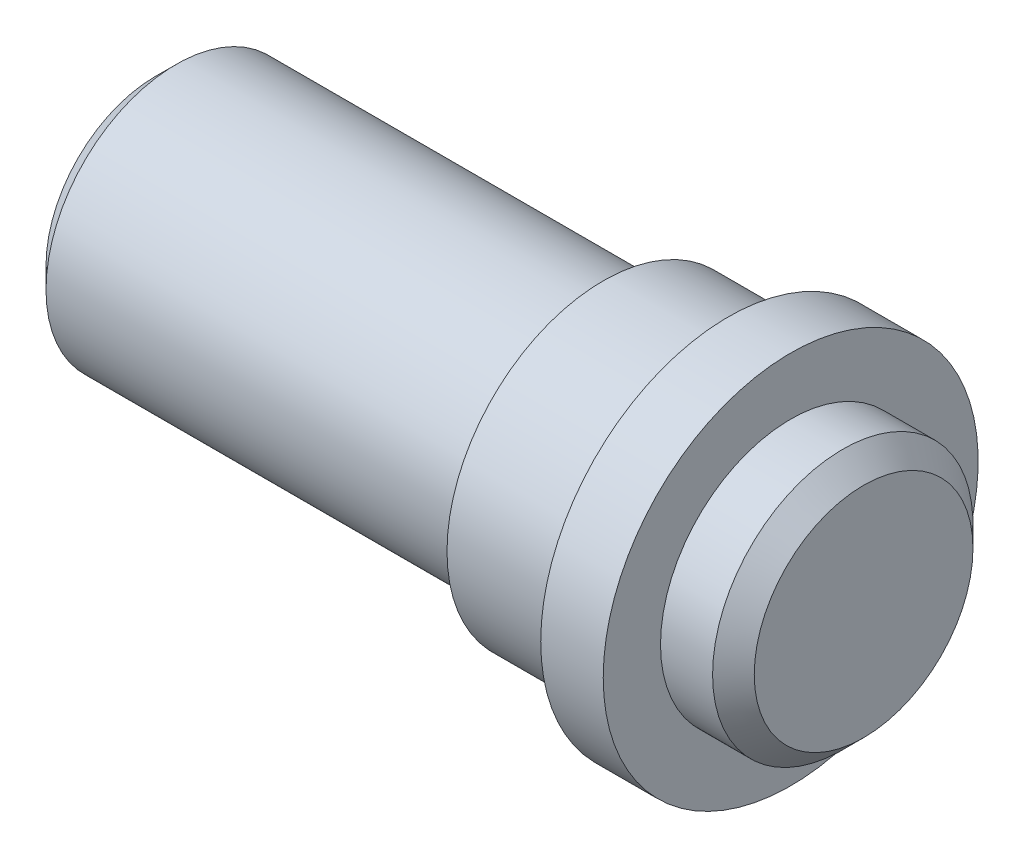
ISO-10303-21;
HEADER;
FILE_DESCRIPTION(('STEP AP214'),'2;1');
FILE_NAME('part.step','',(''),(''),'','','');
FILE_SCHEMA(('AUTOMOTIVE_DESIGN { 1 0 10303 214 1 1 1 1 }'));
ENDSEC;
DATA;
#1=APPLICATION_CONTEXT('core data for automotive mechanical design processes');
#2=APPLICATION_PROTOCOL_DEFINITION('international standard','automotive_design',2000,#1);
#3=PRODUCT_CONTEXT('',#1,'mechanical');
#4=PRODUCT('Part','Part','',(#3));
#5=PRODUCT_RELATED_PRODUCT_CATEGORY('part','',(#4));
#6=PRODUCT_DEFINITION_FORMATION('','',#4);
#7=PRODUCT_DEFINITION_CONTEXT('part definition',#1,'design');
#8=PRODUCT_DEFINITION('design','',#6,#7);
#9=PRODUCT_DEFINITION_SHAPE('','',#8);
#10=(LENGTH_UNIT() NAMED_UNIT(*) SI_UNIT(.MILLI.,.METRE.));
#11=(NAMED_UNIT(*) PLANE_ANGLE_UNIT() SI_UNIT($,.RADIAN.));
#12=(NAMED_UNIT(*) SI_UNIT($,.STERADIAN.) SOLID_ANGLE_UNIT());
#13=UNCERTAINTY_MEASURE_WITH_UNIT(LENGTH_MEASURE(1.E-05),#10,'distance_accuracy_value','');
#14=(GEOMETRIC_REPRESENTATION_CONTEXT(3) GLOBAL_UNCERTAINTY_ASSIGNED_CONTEXT((#13)) GLOBAL_UNIT_ASSIGNED_CONTEXT((#10,
#11,#12)) REPRESENTATION_CONTEXT('',''));
#15=CARTESIAN_POINT('',(0.,0.,0.));
#16=DIRECTION('',(0.,0.,1.));
#17=DIRECTION('',(1.,0.,0.));
#18=AXIS2_PLACEMENT_3D('',#15,#16,#17);
#19=CARTESIAN_POINT('',(0.,0.,0.));
#20=DIRECTION('',(1.,0.,0.));
#21=DIRECTION('',(0.,0.,-1.));
#22=AXIS2_PLACEMENT_3D('',#19,#20,#21);
#23=PLANE('',#22);
#24=CARTESIAN_POINT('',(0.,0.,0.));
#25=DIRECTION('',(-1.,0.,0.));
#26=DIRECTION('',(0.,0.,1.));
#27=AXIS2_PLACEMENT_3D('',#24,#25,#26);
#28=CIRCLE('',#27,3.99999999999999);
#29=CARTESIAN_POINT('',(0.,0.,3.99999999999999));
#30=VERTEX_POINT('',#29);
#31=EDGE_CURVE('E57',#30,#30,#28,.T.);
#32=ORIENTED_EDGE('',*,*,#31,.F.);
#33=EDGE_LOOP('',(#32));
#34=FACE_BOUND('',#33,.T.);
#35=CARTESIAN_POINT('',(0.,0.,0.));
#36=DIRECTION('',(1.,0.,0.));
#37=DIRECTION('',(0.,0.,-1.));
#38=AXIS2_PLACEMENT_3D('',#35,#36,#37);
#39=CIRCLE('',#38,10.5);
#40=CARTESIAN_POINT('',(0.,0.,-10.5));
#41=VERTEX_POINT('',#40);
#42=EDGE_CURVE('E37',#41,#41,#39,.F.);
#43=ORIENTED_EDGE('',*,*,#42,.T.);
#44=EDGE_LOOP('',(#43));
#45=FACE_BOUND('',#44,.T.);
#46=ADVANCED_FACE('F31',(#34,#45),#23,.F.);
#47=CARTESIAN_POINT('',(0.,0.,0.));
#48=DIRECTION('',(-1.,0.,0.));
#49=DIRECTION('',(0.,0.,1.));
#50=AXIS2_PLACEMENT_3D('',#47,#48,#49);
#51=CYLINDRICAL_SURFACE('',#50,12.5);
#52=CARTESIAN_POINT('',(2.00000000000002,0.,0.));
#53=DIRECTION('',(1.,0.,0.));
#54=DIRECTION('',(0.,0.,-1.));
#55=AXIS2_PLACEMENT_3D('',#52,#53,#54);
#56=CIRCLE('',#55,12.5);
#57=CARTESIAN_POINT('',(2.00000000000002,0.,-12.5));
#58=VERTEX_POINT('',#57);
#59=EDGE_CURVE('E11',#58,#58,#56,.T.);
#60=ORIENTED_EDGE('',*,*,#59,.T.);
#61=EDGE_LOOP('',(#60));
#62=FACE_BOUND('',#61,.T.);
#63=CARTESIAN_POINT('',(43.,0.,0.));
#64=DIRECTION('',(-1.,0.,0.));
#65=DIRECTION('',(0.,0.,1.));
#66=AXIS2_PLACEMENT_3D('',#63,#64,#65);
#67=CIRCLE('',#66,12.5);
#68=CARTESIAN_POINT('',(43.,0.,12.5));
#69=VERTEX_POINT('',#68);
#70=EDGE_CURVE('E75',#69,#69,#67,.T.);
#71=ORIENTED_EDGE('',*,*,#70,.T.);
#72=EDGE_LOOP('',(#71));
#73=FACE_BOUND('',#72,.T.);
#74=ADVANCED_FACE('F105',(#62,#73),#51,.T.);
#75=CARTESIAN_POINT('',(43.,12.5,0.));
#76=DIRECTION('',(1.,0.,0.));
#77=DIRECTION('',(0.,0.,-1.));
#78=AXIS2_PLACEMENT_3D('',#75,#76,#77);
#79=PLANE('',#78);
#80=ORIENTED_EDGE('',*,*,#70,.F.);
#81=EDGE_LOOP('',(#80));
#82=FACE_BOUND('',#81,.T.);
#83=CARTESIAN_POINT('',(43.,0.,0.));
#84=DIRECTION('',(-1.,0.,0.));
#85=DIRECTION('',(0.,0.,1.));
#86=AXIS2_PLACEMENT_3D('',#83,#84,#85);
#87=CIRCLE('',#86,15.);
#88=CARTESIAN_POINT('',(43.,0.,15.));
#89=VERTEX_POINT('',#88);
#90=EDGE_CURVE('E72',#89,#89,#87,.T.);
#91=ORIENTED_EDGE('',*,*,#90,.T.);
#92=EDGE_LOOP('',(#91));
#93=FACE_BOUND('',#92,.T.);
#94=ADVANCED_FACE('F110',(#82,#93),#79,.F.);
#95=CARTESIAN_POINT('',(0.,0.,0.));
#96=DIRECTION('',(-1.,0.,0.));
#97=DIRECTION('',(0.,0.,1.));
#98=AXIS2_PLACEMENT_3D('',#95,#96,#97);
#99=CYLINDRICAL_SURFACE('',#98,15.);
#100=ORIENTED_EDGE('',*,*,#90,.F.);
#101=EDGE_LOOP('',(#100));
#102=FACE_BOUND('',#101,.T.);
#103=CARTESIAN_POINT('',(55.,0.,0.));
#104=DIRECTION('',(-1.,0.,0.));
#105=DIRECTION('',(0.,0.,1.));
#106=AXIS2_PLACEMENT_3D('',#103,#104,#105);
#107=CIRCLE('',#106,15.);
#108=CARTESIAN_POINT('',(55.,0.,15.));
#109=VERTEX_POINT('',#108);
#110=EDGE_CURVE('E69',#109,#109,#107,.T.);
#111=ORIENTED_EDGE('',*,*,#110,.T.);
#112=EDGE_LOOP('',(#111));
#113=FACE_BOUND('',#112,.T.);
#114=ADVANCED_FACE('F119',(#102,#113),#99,.T.);
#115=CARTESIAN_POINT('',(55.,15.,0.));
#116=DIRECTION('',(1.,0.,0.));
#117=DIRECTION('',(0.,0.,-1.));
#118=AXIS2_PLACEMENT_3D('',#115,#116,#117);
#119=PLANE('',#118);
#120=ORIENTED_EDGE('',*,*,#110,.F.);
#121=EDGE_LOOP('',(#120));
#122=FACE_BOUND('',#121,.T.);
#123=CARTESIAN_POINT('',(55.,0.,0.));
#124=DIRECTION('',(-1.,0.,0.));
#125=DIRECTION('',(0.,0.,1.));
#126=AXIS2_PLACEMENT_3D('',#123,#124,#125);
#127=CIRCLE('',#126,18.);
#128=CARTESIAN_POINT('',(55.,0.,18.));
#129=VERTEX_POINT('',#128);
#130=EDGE_CURVE('E66',#129,#129,#127,.T.);
#131=ORIENTED_EDGE('',*,*,#130,.T.);
#132=EDGE_LOOP('',(#131));
#133=FACE_BOUND('',#132,.T.);
#134=ADVANCED_FACE('F126',(#122,#133),#119,.F.);
#135=CARTESIAN_POINT('',(0.,0.,0.));
#136=DIRECTION('',(-1.,0.,0.));
#137=DIRECTION('',(0.,0.,1.));
#138=AXIS2_PLACEMENT_3D('',#135,#136,#137);
#139=CYLINDRICAL_SURFACE('',#138,18.);
#140=ORIENTED_EDGE('',*,*,#130,.F.);
#141=EDGE_LOOP('',(#140));
#142=FACE_BOUND('',#141,.T.);
#143=CARTESIAN_POINT('',(61.,0.,0.));
#144=DIRECTION('',(-1.,0.,0.));
#145=DIRECTION('',(0.,0.,1.));
#146=AXIS2_PLACEMENT_3D('',#143,#144,#145);
#147=CIRCLE('',#146,18.);
#148=CARTESIAN_POINT('',(61.,0.,18.));
#149=VERTEX_POINT('',#148);
#150=EDGE_CURVE('E63',#149,#149,#147,.T.);
#151=ORIENTED_EDGE('',*,*,#150,.T.);
#152=EDGE_LOOP('',(#151));
#153=FACE_BOUND('',#152,.T.);
#154=ADVANCED_FACE('F130',(#142,#153),#139,.T.);
#155=CARTESIAN_POINT('',(61.,18.,0.));
#156=DIRECTION('',(-1.,0.,0.));
#157=DIRECTION('',(0.,0.,1.));
#158=AXIS2_PLACEMENT_3D('',#155,#156,#157);
#159=PLANE('',#158);
#160=ORIENTED_EDGE('',*,*,#150,.F.);
#161=EDGE_LOOP('',(#160));
#162=FACE_BOUND('',#161,.T.);
#163=CARTESIAN_POINT('',(61.,0.,0.));
#164=DIRECTION('',(-1.,0.,0.));
#165=DIRECTION('',(0.,0.,1.));
#166=AXIS2_PLACEMENT_3D('',#163,#164,#165);
#167=CIRCLE('',#166,12.5);
#168=CARTESIAN_POINT('',(61.,0.,12.5));
#169=VERTEX_POINT('',#168);
#170=EDGE_CURVE('E60',#169,#169,#167,.T.);
#171=ORIENTED_EDGE('',*,*,#170,.T.);
#172=EDGE_LOOP('',(#171));
#173=FACE_BOUND('',#172,.T.);
#174=ADVANCED_FACE('F134',(#162,#173),#159,.F.);
#175=CARTESIAN_POINT('',(0.,0.,0.));
#176=DIRECTION('',(-1.,0.,0.));
#177=DIRECTION('',(0.,0.,1.));
#178=AXIS2_PLACEMENT_3D('',#175,#176,#177);
#179=CYLINDRICAL_SURFACE('',#178,12.5);
#180=CARTESIAN_POINT('',(66.,0.,0.));
#181=DIRECTION('',(-1.,0.,0.));
#182=DIRECTION('',(0.,0.,1.));
#183=AXIS2_PLACEMENT_3D('',#180,#181,#182);
#184=CIRCLE('',#183,12.5);
#185=CARTESIAN_POINT('',(66.,0.,12.5));
#186=VERTEX_POINT('',#185);
#187=EDGE_CURVE('E78',#186,#186,#184,.T.);
#188=ORIENTED_EDGE('',*,*,#187,.T.);
#189=EDGE_LOOP('',(#188));
#190=FACE_BOUND('',#189,.T.);
#191=ORIENTED_EDGE('',*,*,#170,.F.);
#192=EDGE_LOOP('',(#191));
#193=FACE_BOUND('',#192,.T.);
#194=ADVANCED_FACE('F137',(#190,#193),#179,.T.);
#195=CARTESIAN_POINT('',(68.,12.5,0.));
#196=DIRECTION('',(-1.,0.,0.));
#197=DIRECTION('',(0.,0.,1.));
#198=AXIS2_PLACEMENT_3D('',#195,#196,#197);
#199=PLANE('',#198);
#200=CARTESIAN_POINT('',(68.,0.,0.));
#201=DIRECTION('',(-1.,0.,0.));
#202=DIRECTION('',(0.,0.,1.));
#203=AXIS2_PLACEMENT_3D('',#200,#201,#202);
#204=CIRCLE('',#203,10.5);
#205=CARTESIAN_POINT('',(68.,0.,10.5));
#206=VERTEX_POINT('',#205);
#207=EDGE_CURVE('E81',#206,#206,#204,.F.);
#208=ORIENTED_EDGE('',*,*,#207,.T.);
#209=EDGE_LOOP('',(#208));
#210=FACE_BOUND('',#209,.T.);
#211=ADVANCED_FACE('F101',(#210),#199,.F.);
#212=CARTESIAN_POINT('',(66.,0.,0.));
#213=DIRECTION('',(-1.,0.,0.));
#214=DIRECTION('',(0.,0.,1.));
#215=AXIS2_PLACEMENT_3D('',#212,#213,#214);
#216=CONICAL_SURFACE('',#215,12.5,0.785398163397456);
#217=ORIENTED_EDGE('',*,*,#207,.F.);
#218=EDGE_LOOP('',(#217));
#219=FACE_BOUND('',#218,.T.);
#220=ORIENTED_EDGE('',*,*,#187,.F.);
#221=EDGE_LOOP('',(#220));
#222=FACE_BOUND('',#221,.T.);
#223=ADVANCED_FACE('F90',(#219,#222),#216,.T.);
#224=CARTESIAN_POINT('',(0.,0.,0.));
#225=DIRECTION('',(1.,0.,0.));
#226=DIRECTION('',(0.,0.,-1.));
#227=AXIS2_PLACEMENT_3D('',#224,#225,#226);
#228=CONICAL_SURFACE('',#227,10.5,0.785398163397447);
#229=ORIENTED_EDGE('',*,*,#59,.F.);
#230=EDGE_LOOP('',(#229));
#231=FACE_BOUND('',#230,.T.);
#232=ORIENTED_EDGE('',*,*,#42,.F.);
#233=EDGE_LOOP('',(#232));
#234=FACE_BOUND('',#233,.T.);
#235=ADVANCED_FACE('F87',(#231,#234),#228,.T.);
#236=CARTESIAN_POINT('',(0.,0.,0.));
#237=DIRECTION('',(-1.,0.,0.));
#238=DIRECTION('',(0.,0.,1.));
#239=AXIS2_PLACEMENT_3D('',#236,#237,#238);
#240=CYLINDRICAL_SURFACE('',#239,3.99999999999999);
#241=CARTESIAN_POINT('',(20.,0.,0.));
#242=DIRECTION('',(-1.,0.,0.));
#243=DIRECTION('',(0.,0.,1.));
#244=AXIS2_PLACEMENT_3D('',#241,#242,#243);
#245=CIRCLE('',#244,4.);
#246=CARTESIAN_POINT('',(20.,0.,4.));
#247=VERTEX_POINT('',#246);
#248=EDGE_CURVE('E52',#247,#247,#245,.T.);
#249=ORIENTED_EDGE('',*,*,#248,.F.);
#250=EDGE_LOOP('',(#249));
#251=FACE_BOUND('',#250,.T.);
#252=ORIENTED_EDGE('',*,*,#31,.T.);
#253=EDGE_LOOP('',(#252));
#254=FACE_BOUND('',#253,.T.);
#255=ADVANCED_FACE('F89',(#251,#254),#240,.F.);
#256=CARTESIAN_POINT('',(20.,3.39999999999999,0.));
#257=DIRECTION('',(1.,0.,0.));
#258=DIRECTION('',(0.,0.,-1.));
#259=AXIS2_PLACEMENT_3D('',#256,#257,#258);
#260=PLANE('',#259);
#261=CARTESIAN_POINT('',(20.,0.,0.));
#262=DIRECTION('',(-1.,0.,0.));
#263=DIRECTION('',(0.,0.,1.));
#264=AXIS2_PLACEMENT_3D('',#261,#262,#263);
#265=CIRCLE('',#264,3.39999999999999);
#266=CARTESIAN_POINT('',(20.,0.,3.39999999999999));
#267=VERTEX_POINT('',#266);
#268=EDGE_CURVE('E49',#267,#267,#265,.T.);
#269=ORIENTED_EDGE('',*,*,#268,.F.);
#270=EDGE_LOOP('',(#269));
#271=FACE_BOUND('',#270,.T.);
#272=ORIENTED_EDGE('',*,*,#248,.T.);
#273=EDGE_LOOP('',(#272));
#274=FACE_BOUND('',#273,.T.);
#275=ADVANCED_FACE('F98',(#271,#274),#260,.F.);
#276=CARTESIAN_POINT('',(0.,0.,0.));
#277=DIRECTION('',(-1.,0.,0.));
#278=DIRECTION('',(0.,0.,1.));
#279=AXIS2_PLACEMENT_3D('',#276,#277,#278);
#280=CYLINDRICAL_SURFACE('',#279,3.39999999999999);
#281=CARTESIAN_POINT('',(23.75,0.,0.));
#282=DIRECTION('',(-1.,0.,0.));
#283=DIRECTION('',(0.,0.,1.));
#284=AXIS2_PLACEMENT_3D('',#281,#282,#283);
#285=CIRCLE('',#284,3.39999999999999);
#286=CARTESIAN_POINT('',(23.75,0.,3.39999999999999));
#287=VERTEX_POINT('',#286);
#288=EDGE_CURVE('E47',#287,#287,#285,.T.);
#289=ORIENTED_EDGE('',*,*,#288,.F.);
#290=EDGE_LOOP('',(#289));
#291=FACE_BOUND('',#290,.T.);
#292=ORIENTED_EDGE('',*,*,#268,.T.);
#293=EDGE_LOOP('',(#292));
#294=FACE_BOUND('',#293,.T.);
#295=ADVANCED_FACE('F43',(#291,#294),#280,.F.);
#296=CARTESIAN_POINT('',(23.75,0.,0.));
#297=DIRECTION('',(-1.,0.,0.));
#298=DIRECTION('',(0.,0.,1.));
#299=AXIS2_PLACEMENT_3D('',#296,#297,#298);
#300=CONICAL_SURFACE('',#299,3.39999999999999,1.02974425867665);
#301=CARTESIAN_POINT('',(25.7929261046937,0.,0.));
#302=VERTEX_POINT('',#301);
#303=VERTEX_LOOP('',#302);
#304=FACE_BOUND('',#303,.T.);
#305=ORIENTED_EDGE('',*,*,#288,.T.);
#306=EDGE_LOOP('',(#305));
#307=FACE_BOUND('',#306,.T.);
#308=ADVANCED_FACE('F40',(#304,#307),#300,.F.);
#309=CLOSED_SHELL('',(#46,#74,#94,#114,#134,#154,#174,#194,#211,#223,#235,#255,#275,#295,#308));
#310=MANIFOLD_SOLID_BREP('B2',#309);
#311=ADVANCED_BREP_SHAPE_REPRESENTATION('',(#18,#310),#14);
#312=SHAPE_DEFINITION_REPRESENTATION(#9,#311);
ENDSEC;
END-ISO-10303-21;
